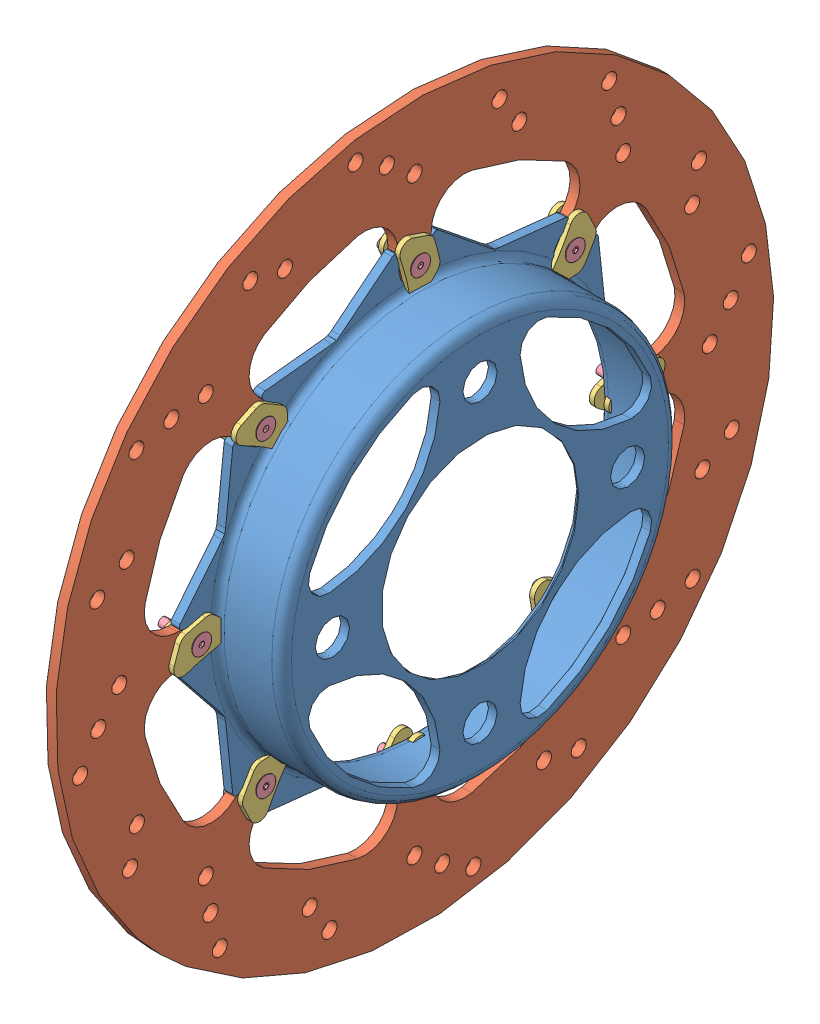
SolidWorks assembly Brake Rotor Assembly.SLDASM, configuration Default (file format 13000). Lengths in mm.
Overall size (31.81 327.78 327.78).
26 component instances, 4 part files, 10 mates.
Components (placement in the parent):
- Rotor Hat-1: Rotor Hat.SLDPRT [Default] at (-34.2242 30.4071 -2.5985) size (23.6 152.4 152.4)
- Rotor - Cast Iron-1: Rotor - Cast Iron.SLDPRT [Default] at (-34.926 30.4071 -2.5985) x (0 -0.707107 0.707107) z (1 0 0) size (231.78 231.78 3.17)
- Rotor Washer-1: Rotor Washer.SLDPRT [Default] at (-34.926 -45.1409 39.6169) x (0 -0.351842 0.936059) z (-1 0 0) size (18.57 10.78 1.59)
- Rotor Washer-27: Rotor Washer.SLDPRT [Chamfer] at (-31.751 -47.6779 47.6027) x (0 0.252895 -0.967494) z (1 0 0) size (18.57 10.78 1.59)
- Rotor Pin-6: Rotor Pin.SLDPRT [.5] at (-31.201 30.4071 68.0135) x (0 -0.458801 0.888539) z (1 0 0) size (6.36 6.36 12.79)
- Rotor Washer-13: Rotor Washer.SLDPRT [Default] at (-34.926 6.8374 80.6728) x (0 0.413104 0.910684) z (-1 0 0) size (18.57 10.78 1.59)
- Rotor Washer-14: Rotor Washer.SLDPRT [Default] at (-34.926 72.6224 72.9495) x (0 0.936059 0.351842) z (-1 0 0) size (18.57 10.78 1.59)
- Rotor Washer-15: Rotor Washer.SLDPRT [Default] at (-34.926 113.6783 20.9712) x (0 0.910684 -0.413104) z (-1 0 0) size (18.57 10.78 1.59)
- Rotor Washer-16: Rotor Washer.SLDPRT [Default] at (-34.926 105.955 -44.8139) x (0 0.351842 -0.936059) z (-1 0 0) size (18.57 10.78 1.59)
- Rotor Washer-17: Rotor Washer.SLDPRT [Default] at (-34.926 53.9768 -85.8697) x (0 -0.413104 -0.910684) z (-1 0 0) size (18.57 10.78 1.59)
- Rotor Pin-7: Rotor Pin.SLDPRT [.5] at (-31.201 80.3373 47.3317) x (0 0.30387 0.952713) z (1 0 0) size (6.36 6.36 12.79)
- Rotor Pin-8: Rotor Pin.SLDPRT [.5] at (-31.201 101.0191 -2.5985) x (0 0.888539 0.458801) z (1 0 0) size (6.36 6.36 12.79)
- Rotor Pin-9: Rotor Pin.SLDPRT [.5] at (-31.201 80.3373 -52.5287) x (0 0.952713 -0.30387) z (1 0 0) size (6.36 6.36 12.79)
- Rotor Pin-10: Rotor Pin.SLDPRT [.5] at (-31.201 30.4071 -73.2105) x (0 0.458801 -0.888539) z (1 0 0) size (6.36 6.36 12.79)
- Rotor Pin-11: Rotor Pin.SLDPRT [.5] at (-31.201 -19.5231 -52.5287) x (0 -0.30387 -0.952713) z (1 0 0) size (6.36 6.36 12.79)
- Rotor Pin-12: Rotor Pin.SLDPRT [.5] at (-31.201 -40.2049 -2.5985) x (0 -0.888539 -0.458801) z (1 0 0) size (6.36 6.36 12.79)
- Rotor Pin-13: Rotor Pin.SLDPRT [.5] at (-31.201 -19.5231 47.3317) x (0 -0.952713 0.30387) z (1 0 0) size (6.36 6.36 12.79)
- Rotor Washer-25: Rotor Washer.SLDPRT [Default] at (-34.926 -11.8083 -78.1464) x (0 -0.936059 -0.351842) z (-1 0 0) size (18.57 10.78 1.59)
- Rotor Washer-26: Rotor Washer.SLDPRT [Default] at (-34.926 -52.8642 -26.1682) x (0 -0.910684 0.413104) z (-1 0 0) size (18.57 10.78 1.59)
- Rotor Washer-28: Rotor Washer.SLDPRT [Chamfer] at (-31.751 10.6903 88.1135) x (0 -0.505298 -0.862945) z (1 0 0) size (18.57 10.78 1.59)
- Rotor Washer-29: Rotor Washer.SLDPRT [Chamfer] at (-31.751 80.6083 75.4865) x (0 -0.967494 -0.252895) z (1 0 0) size (18.57 10.78 1.59)
- Rotor Washer-30: Rotor Washer.SLDPRT [Chamfer] at (-31.751 121.1191 17.1183) x (0 -0.862945 0.505298) z (1 0 0) size (18.57 10.78 1.59)
- Rotor Washer-31: Rotor Washer.SLDPRT [Chamfer] at (-31.751 108.492 -52.7997) x (0 -0.252895 0.967494) z (1 0 0) size (18.57 10.78 1.59)
- Rotor Washer-32: Rotor Washer.SLDPRT [Chamfer] at (-31.751 50.1239 -93.3105) x (0 0.505298 0.862945) z (1 0 0) size (18.57 10.78 1.59)
- Rotor Washer-33: Rotor Washer.SLDPRT [Chamfer] at (-31.751 -19.7942 -80.6835) x (0 0.967494 0.252895) z (1 0 0) size (18.57 10.78 1.59)
- Rotor Washer-34: Rotor Washer.SLDPRT [Chamfer] at (-31.751 -60.305 -22.3153) x (0 0.862945 -0.505298) z (1 0 0) size (18.57 10.78 1.59)
Mates (geometry in assembly coordinates):
- Coincident1: coincident anti-aligned: plane of Rotor - Cast Iron-1 through (-34.927 106.8152 2.799) normal (0 0 1); plane of Rotor Hat-1 through (-10.6199 -44.5229 2.799) normal (0 0 -1)
- Distance1: distance = 0.1905 mm aligned: plane of Rotor Hat-1 through (-34.2242 95.5581 -2.5985) normal (-1 0 0); plane of Rotor - Cast Iron-1 through (-34.4147 210.7857 177.7802) normal (-1 0 0)
- Distance2: distance = 0.1905 mm aligned: plane of Rotor Hat-1 through (-34.2242 95.5581 -2.5985) normal (-1 0 0); plane of Rotor - Cast Iron-1 through (-31.751 210.7857 177.7802) normal (1 0 0)
- Coincident3: coincident anti-aligned: plane of Rotor - Cast Iron-1 through (-34.926 210.7857 177.7802) normal (-1 0 0); plane of Rotor Washer-1 through (-34.926 31.8488 71.9473) normal (1 0 0)
- Concentric4: concentric aligned: cylinder of Rotor Washer-1 through (-36.5135 30.4071 68.0135) axis (1 0 0) radius 1.5875; cylinder of Rotor - Cast Iron-1 through (-34.927 30.4071 68.0135) axis (1 0 0) radius 1.5875
- Coincident5: coincident anti-aligned: plane of Rotor - Cast Iron-1 through (-31.751 210.7857 177.7802) normal (1 0 0); plane of Rotor Washer-27 through (-31.751 33.8548 65.633) normal (-1 0 0)
- Concentric9: concentric anti-aligned: cylinder of Rotor Pin-6 through (-31.201 30.4071 68.0135) axis (-1 0 0) radius 1.4224; cylinder of Rotor - Cast Iron-1 through (-34.927 30.4071 68.0135) axis (1 0 0) radius 1.5875
- Coincident6: coincident aligned: cone of Rotor Washer-27 through (-31.6245 30.4071 68.0135) axis (-1 0 0); cone of Rotor Pin-6 through (-29.7252 30.4071 68.0135) axis (-1 0 0)
- Concentric12: concentric anti-aligned: cylinder of Rotor - Cast Iron-1 through (-31.751 30.4071 -2.5985) axis (-1 0 0) radius 115.8875; circle of Rotor Hat-1
- Concentric13: concentric anti-aligned: cylinder of Rotor - Cast Iron-1 through (-31.751 30.4071 -2.5985) axis (-1 0 0) radius 115.8875; cylinder of Rotor Hat-1 through (-8.3543 30.4071 -2.5985) axis (1 0 0) radius 64.008
